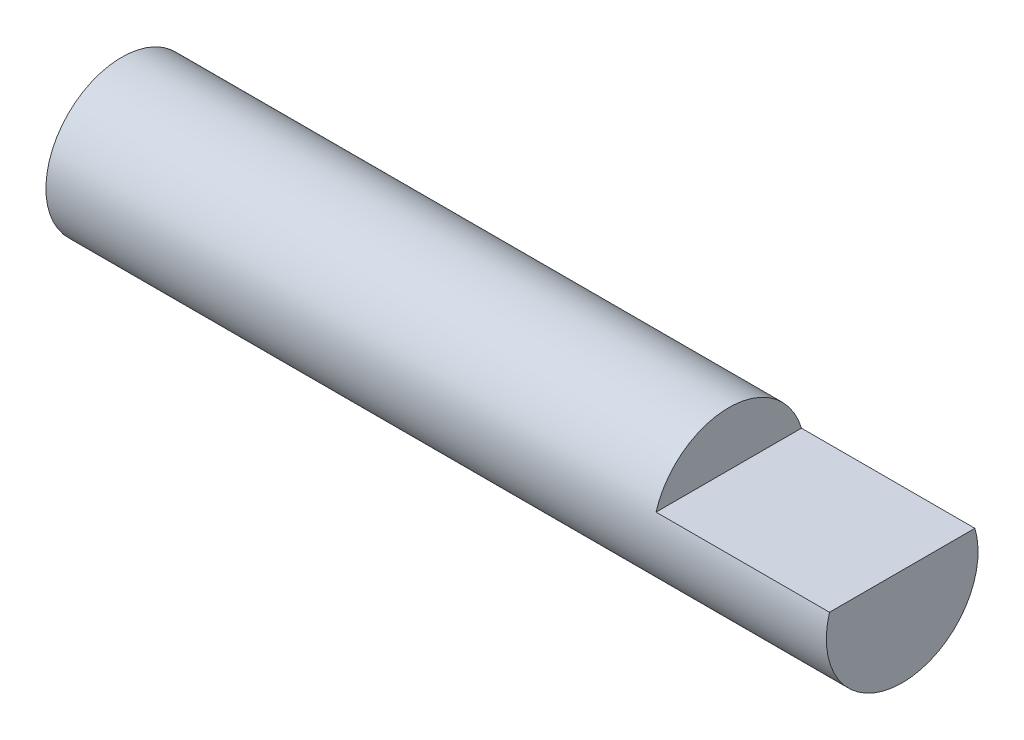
from build123d import *

# Parameters (mm, degrees)
SKETCH1_R          = 5.55625
BASE_EXTRUDE_DEPTH = 57.15
CUT_EXTRUDE1_START = -12.7
CUT_EXTRUDE1_DEPTH = 12.7


with BuildPart() as part:
    # Sketch1 → Base-Extrude (new body)
    with BuildSketch(Plane(origin=(0, 0, 0), x_dir=(0, 0, -1), z_dir=(1, 0, 0))):
        Circle(SKETCH1_R)
    extrude(amount=BASE_EXTRUDE_DEPTH)

    # Sketch2 → Cut-Extrude1 (cut)
    with BuildSketch(Plane(origin=(57.15, 0, 0), x_dir=(0, 0, -1), z_dir=(1, 0, 0)).offset(CUT_EXTRUDE1_START)):
        with BuildLine():
            Line((-5.324636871, 1.5875), (5.324636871, 1.5875))
            ThreePointArc((5.324636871, 1.5875), (0, 5.55625), (-5.324636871, 1.5875))
        make_face()
    extrude(amount=CUT_EXTRUDE1_DEPTH, mode=Mode.SUBTRACT)


solid = part.part
